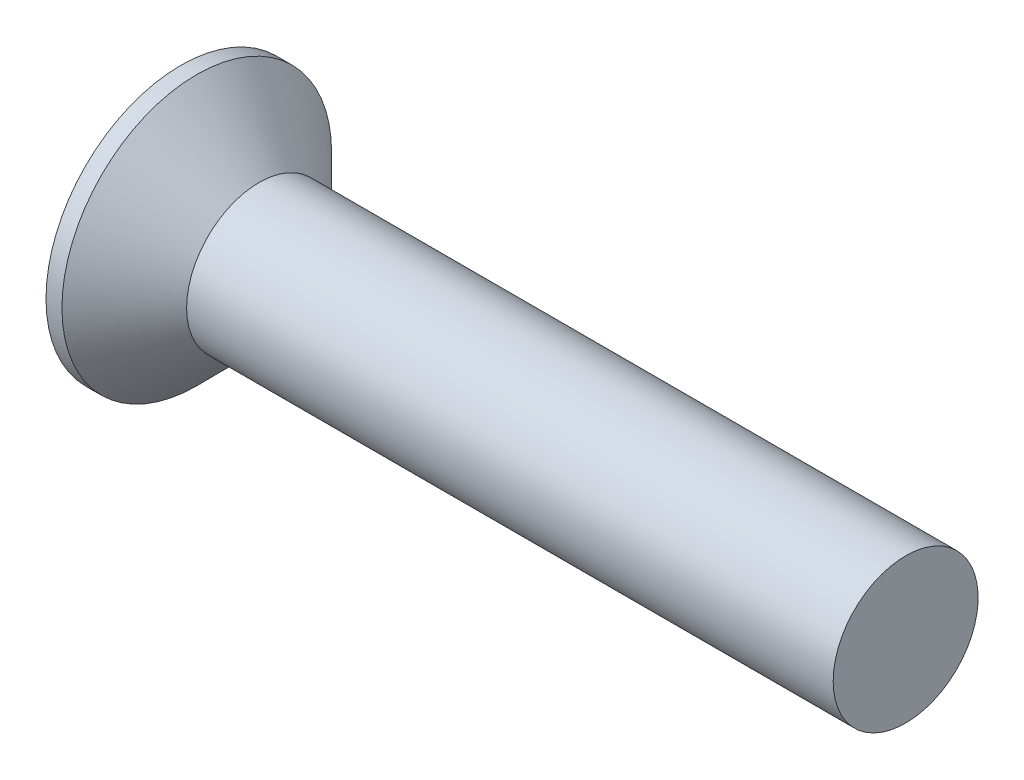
from build123d import *

# Parameters (mm, degrees)
CIRPATTERN1_COUNT = 2
CIRPATTERN1_ANGLE = 90


with BuildPart() as part:
    # BodySke → Base-Revolve (revolve)
    with BuildSketch(Plane.XY, mode=Mode.PRIVATE) as base_revolve_sk:
        Polygon((0, 0), (0, 4.65), (0.55, 4.65), (2.7, 2.5), (25, 2.5), (25, 0), align=None)
    revolve(base_revolve_sk.sketch.rotate(Axis((-6.35, 0, 0), (1, 0, 0)), 90), axis=Axis((-6.35, 0, 0), (1, 0, 0)))

    # Sketch3 → Cross section 0
    with BuildSketch(Plane.ZY):
        with BuildLine():
            Line((-0.52, 2.53), (0.52, 2.53))
            Line((0.52, 2.53), (0.52, -2.53))
            Line((0.52, -2.53), (-0.52, -2.53))
            Line((-0.52, -2.53), (-0.52, 2.53))
        make_face()
    # Sketch4 → Cross section 1
    with BuildSketch(Plane.ZY.offset(-3.35)):
        with BuildLine():
            Line((-0.26, 0.26), (0.26, 0.26))
            Line((0.26, 0.26), (0.26, -0.26))
            Line((0.26, -0.26), (-0.26, -0.26))
            Line((-0.26, -0.26), (-0.26, 0.26))
        make_face()
    cross = loft(mode=Mode.SUBTRACT)

    # CirPattern1: Cross ×2 about axis
    cirpattern1_axis = Axis((0, 0, 0), (1, 0, 0))
    for i in range(1, CIRPATTERN1_COUNT):
        add(cross.rotate(cirpattern1_axis, i * CIRPATTERN1_ANGLE / (CIRPATTERN1_COUNT - 1)), mode=Mode.SUBTRACT)


solid = part.part
